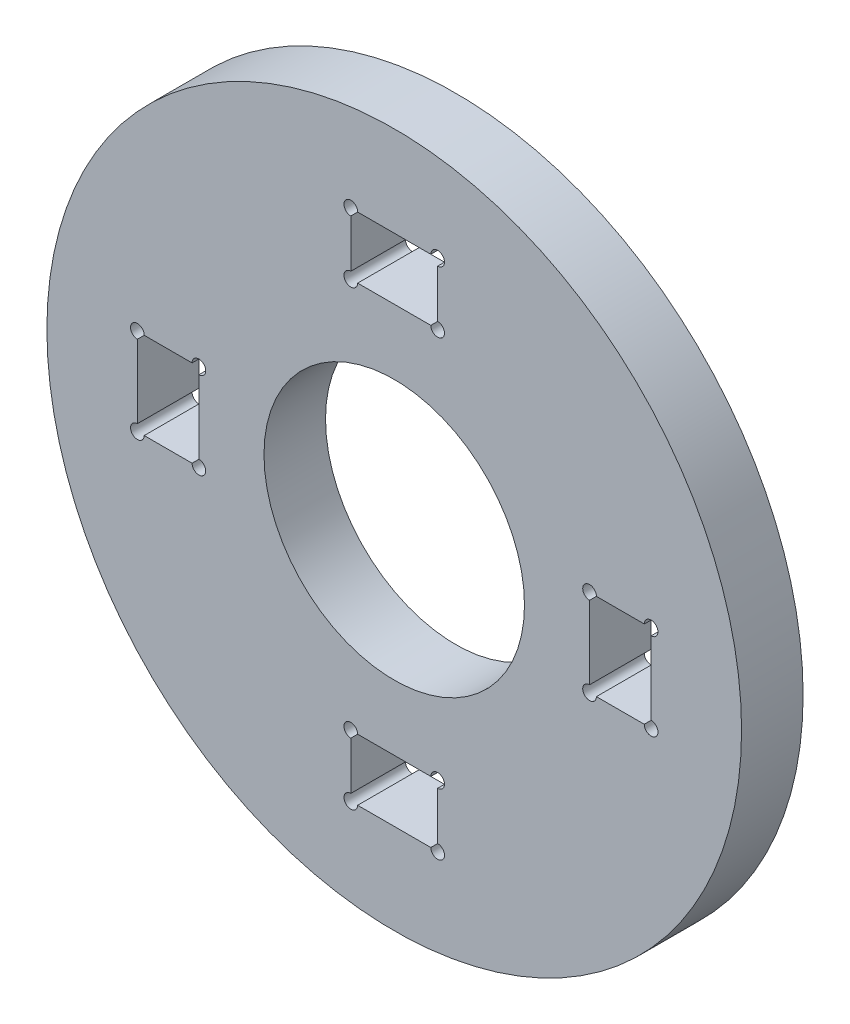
from build123d import *

# Parameters (mm, degrees)
SKETCH1_R           = 25.4
SKETCH1_R_2         = 2.5
BOSS_EXTRUDE1_DEPTH = 4.5
CUT_EXTRUDE1_DEPTH  = 37.201795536
SKETCH3_R           = 9.525
CUT_EXTRUDE2_DEPTH  = 37.201795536


with BuildPart() as part:
    # Sketch1 → Boss-Extrude1 (new body)
    with BuildSketch(Plane.XY):
        Circle(SKETCH1_R)
        Circle(SKETCH1_R_2, mode=Mode.SUBTRACT)
    extrude(amount=BOSS_EXTRUDE1_DEPTH)

    # Sketch2 → Cut-Extrude1 (cut, through all)
    with BuildSketch(Plane.XY.offset(4.5)):
        with BuildLine():
            Line((-14.783553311, 3.175), (-17.171437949, 3.175))
            ThreePointArc((-17.171437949, 3.175), (-17.4625, 0), (-17.171437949, -3.175))
            Line((-17.171437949, -3.175), (-14.783553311, -3.175))
            Line((-14.783553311, -3.175), (-14.283553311, -3.175))
            Line((-14.283553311, -3.175), (-14.283553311, -2.675))
            Line((-14.283553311, -2.675), (-14.283553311, 2.675))
            Line((-14.283553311, 2.675), (-14.283553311, 3.175))
            Line((-14.283553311, 3.175), (-14.783553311, 3.175))
        make_face()
        with BuildLine():
            ThreePointArc((-17.171437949, -3.175), (-17.4625, 0), (-17.171437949, 3.175))
            Line((-17.171437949, 3.175), (-18.283553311, 3.175))
            Line((-18.283553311, 3.175), (-18.783553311, 3.175))
            Line((-18.783553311, 3.175), (-18.783553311, 2.675))
            Line((-18.783553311, 2.675), (-18.783553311, -2.675))
            Line((-18.783553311, -2.675), (-18.783553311, -3.175))
            Line((-18.783553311, -3.175), (-18.283553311, -3.175))
            Line((-18.283553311, -3.175), (-17.171437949, -3.175))
        make_face()
        with BuildLine():
            Line((2.675, 18.783553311), (0, 18.783553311))
            Line((0, 18.783553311), (0, 17.4625))
            ThreePointArc((0, 17.4625), (1.594156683, 17.389582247), (3.175, 17.171437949))
            Line((3.175, 17.171437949), (3.175, 18.283553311))
            Line((3.175, 18.283553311), (3.175, 18.783553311))
            Line((3.175, 18.783553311), (2.675, 18.783553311))
        make_face()
        with BuildLine():
            Line((0, 17.4625), (0, 18.783553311))
            Line((0, 18.783553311), (-2.675, 18.783553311))
            Line((-2.675, 18.783553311), (-3.175, 18.783553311))
            Line((-3.175, 18.783553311), (-3.175, 18.283553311))
            Line((-3.175, 18.283553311), (-3.175, 17.171437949))
            ThreePointArc((-3.175, 17.171437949), (-1.594156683, 17.389582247), (0, 17.4625))
        make_face()
        with BuildLine():
            Line((0, 14.283553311), (0, 17.4625))
            ThreePointArc((0, 17.4625), (-1.594156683, 17.389582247), (-3.175, 17.171437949))
            Line((-3.175, 17.171437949), (-3.175, 14.783553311))
            Line((-3.175, 14.783553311), (-3.175, 14.283553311))
            Line((-3.175, 14.283553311), (-2.675, 14.283553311))
            Line((-2.675, 14.283553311), (0, 14.283553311))
        make_face()
        with BuildLine():
            ThreePointArc((3.175, 17.171437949), (1.594156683, 17.389582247), (0, 17.4625))
            Line((0, 17.4625), (0, 14.283553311))
            Line((0, 14.283553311), (2.675, 14.283553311))
            Line((2.675, 14.283553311), (3.175, 14.283553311))
            Line((3.175, 14.283553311), (3.175, 14.783553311))
            Line((3.175, 14.783553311), (3.175, 17.171437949))
        make_face()
        with BuildLine():
            ThreePointArc((17.4625, 0), (17.389582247, 1.594156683), (17.171437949, 3.175))
            Line((17.171437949, 3.175), (14.783553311, 3.175))
            Line((14.783553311, 3.175), (14.283553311, 3.175))
            Line((14.283553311, 3.175), (14.283553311, 2.675))
            Line((14.283553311, 2.675), (14.283553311, -2.675))
            Line((14.283553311, -2.675), (14.283553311, -3.175))
            Line((14.283553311, -3.175), (14.783553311, -3.175))
            Line((14.783553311, -3.175), (17.171437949, -3.175))
            ThreePointArc((17.171437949, -3.175), (17.389582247, -1.594156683), (17.4625, 0))
        make_face()
        with BuildLine():
            Line((18.283553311, 3.175), (17.171437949, 3.175))
            ThreePointArc((17.171437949, 3.175), (17.389582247, 1.594156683), (17.4625, 0))
            ThreePointArc((17.4625, 0), (17.389582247, -1.594156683), (17.171437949, -3.175))
            Line((17.171437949, -3.175), (18.283553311, -3.175))
            Line((18.283553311, -3.175), (18.783553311, -3.175))
            Line((18.783553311, -3.175), (18.783553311, -2.675))
            Line((18.783553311, -2.675), (18.783553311, 2.675))
            Line((18.783553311, 2.675), (18.783553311, 3.175))
            Line((18.783553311, 3.175), (18.283553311, 3.175))
        make_face()
        with BuildLine():
            Line((-3.175, -14.783553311), (-3.175, -17.171437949))
            ThreePointArc((-3.175, -17.171437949), (0, -17.4625), (3.175, -17.171437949))
            Line((3.175, -17.171437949), (3.175, -14.783553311))
            Line((3.175, -14.783553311), (3.175, -14.283553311))
            Line((3.175, -14.283553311), (2.675, -14.283553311))
            Line((2.675, -14.283553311), (-2.675, -14.283553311))
            Line((-2.675, -14.283553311), (-3.175, -14.283553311))
            Line((-3.175, -14.283553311), (-3.175, -14.783553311))
        make_face()
        with BuildLine():
            ThreePointArc((3.175, -17.171437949), (0, -17.4625), (-3.175, -17.171437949))
            Line((-3.175, -17.171437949), (-3.175, -18.283553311))
            Line((-3.175, -18.283553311), (-3.175, -18.783553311))
            Line((-3.175, -18.783553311), (-2.675, -18.783553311))
            Line((-2.675, -18.783553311), (2.675, -18.783553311))
            Line((2.675, -18.783553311), (3.175, -18.783553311))
            Line((3.175, -18.783553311), (3.175, -18.283553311))
            Line((3.175, -18.283553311), (3.175, -17.171437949))
        make_face()
        with BuildLine():
            Line((-3.175, 18.283553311), (-3.175, 18.783553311))
            ThreePointArc((-3.175, 18.783553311), (-3.421229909, 18.740269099), (-3.66687058, 18.693757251))
            ThreePointArc((-3.66687058, 18.693757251), (-3.495235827, 18.399562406), (-3.175, 18.283553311))
        make_face()
        with BuildLine():
            Line((-3.175, 18.783553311), (-2.675, 18.783553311))
            ThreePointArc((-2.675, 18.783553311), (-2.676487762, 18.822096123), (-2.680942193, 18.860409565))
            ThreePointArc((-2.680942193, 18.860409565), (-2.928223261, 18.823602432), (-3.175, 18.783553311))
        make_face()
        with BuildLine():
            ThreePointArc((-3.66687058, 18.693757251), (-3.421229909, 18.740269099), (-3.175, 18.783553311))
            ThreePointArc((-3.175, 18.783553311), (-2.928223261, 18.823602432), (-2.680942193, 18.860409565))
            ThreePointArc((-2.680942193, 18.860409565), (-3.258333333, 19.27655996), (-3.66687058, 18.693757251))
        make_face()
        with BuildLine():
            ThreePointArc((2.680942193, 18.860409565), (2.676487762, 18.822096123), (2.675, 18.783553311))
            Line((2.675, 18.783553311), (3.175, 18.783553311))
            ThreePointArc((3.175, 18.783553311), (2.928223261, 18.823602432), (2.680942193, 18.860409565))
        make_face()
        with BuildLine():
            ThreePointArc((2.680942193, 18.860409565), (2.928223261, 18.823602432), (3.175, 18.783553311))
            ThreePointArc((3.175, 18.783553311), (3.421229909, 18.740269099), (3.66687058, 18.693757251))
            ThreePointArc((3.66687058, 18.693757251), (3.258333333, 19.27655996), (2.680942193, 18.860409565))
        make_face()
        with BuildLine():
            ThreePointArc((3.66687058, 18.693757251), (3.421229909, 18.740269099), (3.175, 18.783553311))
            Line((3.175, 18.783553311), (3.175, 18.283553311))
            ThreePointArc((3.175, 18.283553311), (3.495235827, 18.399562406), (3.66687058, 18.693757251))
        make_face()
        with BuildLine():
            Line((3.175, 14.283553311), (2.675, 14.283553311))
            ThreePointArc((2.675, 14.283553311), (3.528553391, 13.929999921), (3.175, 14.783553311))
            Line((3.175, 14.783553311), (3.175, 14.283553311))
        make_face()
        with BuildLine():
            ThreePointArc((-3.175, 14.783553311), (-3.528553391, 13.929999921), (-2.675, 14.283553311))
            Line((-2.675, 14.283553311), (-3.175, 14.283553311))
            Line((-3.175, 14.283553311), (-3.175, 14.783553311))
        make_face()
        with BuildLine():
            Line((14.283553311, -3.175), (14.283553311, -2.675))
            ThreePointArc((14.283553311, -2.675), (13.929999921, -3.528553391), (14.783553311, -3.175))
            Line((14.783553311, -3.175), (14.283553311, -3.175))
        make_face()
        with BuildLine():
            Line((14.283553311, 3.175), (14.783553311, 3.175))
            ThreePointArc((14.783553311, 3.175), (13.929999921, 3.528553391), (14.283553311, 2.675))
            Line((14.283553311, 2.675), (14.283553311, 3.175))
        make_face()
        with BuildLine():
            ThreePointArc((18.693757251, 3.66687058), (18.399562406, 3.495235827), (18.283553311, 3.175))
            Line((18.283553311, 3.175), (18.783553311, 3.175))
            ThreePointArc((18.783553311, 3.175), (18.740269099, 3.421229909), (18.693757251, 3.66687058))
        make_face()
        with BuildLine():
            ThreePointArc((18.860409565, 2.680942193), (19.27655996, 3.258333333), (18.693757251, 3.66687058))
            ThreePointArc((18.693757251, 3.66687058), (18.740269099, 3.421229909), (18.783553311, 3.175))
            ThreePointArc((18.783553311, 3.175), (18.823602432, 2.928223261), (18.860409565, 2.680942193))
        make_face()
        with BuildLine():
            ThreePointArc((18.860409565, 2.680942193), (18.823602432, 2.928223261), (18.783553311, 3.175))
            Line((18.783553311, 3.175), (18.783553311, 2.675))
            ThreePointArc((18.783553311, 2.675), (18.822096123, 2.676487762), (18.860409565, 2.680942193))
        make_face()
        with BuildLine():
            Line((18.783553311, -3.175), (18.283553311, -3.175))
            ThreePointArc((18.283553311, -3.175), (18.399562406, -3.495235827), (18.693757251, -3.66687058))
            ThreePointArc((18.693757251, -3.66687058), (18.740269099, -3.421229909), (18.783553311, -3.175))
        make_face()
        with BuildLine():
            ThreePointArc((18.860409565, -2.680942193), (18.823602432, -2.928223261), (18.783553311, -3.175))
            ThreePointArc((18.783553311, -3.175), (18.740269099, -3.421229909), (18.693757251, -3.66687058))
            ThreePointArc((18.693757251, -3.66687058), (19.27655996, -3.258333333), (18.860409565, -2.680942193))
        make_face()
        with BuildLine():
            ThreePointArc((18.860409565, -2.680942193), (18.822096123, -2.676487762), (18.783553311, -2.675))
            Line((18.783553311, -2.675), (18.783553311, -3.175))
            ThreePointArc((18.783553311, -3.175), (18.823602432, -2.928223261), (18.860409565, -2.680942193))
        make_face()
        with BuildLine():
            ThreePointArc((-3.175, -18.783553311), (-3.421229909, -18.740269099), (-3.66687058, -18.693757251))
            ThreePointArc((-3.66687058, -18.693757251), (-3.258333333, -19.27655996), (-2.680942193, -18.860409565))
            ThreePointArc((-2.680942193, -18.860409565), (-2.928223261, -18.823602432), (-3.175, -18.783553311))
        make_face()
        with BuildLine():
            ThreePointArc((-2.675, -14.283553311), (-3.528553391, -13.929999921), (-3.175, -14.783553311))
            Line((-3.175, -14.783553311), (-3.175, -14.283553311))
            Line((-3.175, -14.283553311), (-2.675, -14.283553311))
        make_face()
        with BuildLine():
            Line((3.175, -14.283553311), (3.175, -14.783553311))
            ThreePointArc((3.175, -14.783553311), (3.528553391, -13.929999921), (2.675, -14.283553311))
            Line((2.675, -14.283553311), (3.175, -14.283553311))
        make_face()
        with BuildLine():
            ThreePointArc((2.680942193, -18.860409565), (3.258333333, -19.27655996), (3.66687058, -18.693757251))
            ThreePointArc((3.66687058, -18.693757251), (3.421229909, -18.740269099), (3.175, -18.783553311))
            ThreePointArc((3.175, -18.783553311), (2.928223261, -18.823602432), (2.680942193, -18.860409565))
        make_face()
        with BuildLine():
            ThreePointArc((3.66687058, -18.693757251), (3.495235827, -18.399562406), (3.175, -18.283553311))
            Line((3.175, -18.283553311), (3.175, -18.783553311))
            ThreePointArc((3.175, -18.783553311), (3.421229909, -18.740269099), (3.66687058, -18.693757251))
        make_face()
        with BuildLine():
            ThreePointArc((2.680942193, -18.860409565), (2.928223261, -18.823602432), (3.175, -18.783553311))
            Line((3.175, -18.783553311), (2.675, -18.783553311))
            ThreePointArc((2.675, -18.783553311), (2.676487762, -18.822096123), (2.680942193, -18.860409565))
        make_face()
        with BuildLine():
            Line((-3.175, -18.783553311), (-3.175, -18.283553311))
            ThreePointArc((-3.175, -18.283553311), (-3.495235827, -18.399562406), (-3.66687058, -18.693757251))
            ThreePointArc((-3.66687058, -18.693757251), (-3.421229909, -18.740269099), (-3.175, -18.783553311))
        make_face()
        with BuildLine():
            Line((-2.675, -18.783553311), (-3.175, -18.783553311))
            ThreePointArc((-3.175, -18.783553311), (-2.928223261, -18.823602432), (-2.680942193, -18.860409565))
            ThreePointArc((-2.680942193, -18.860409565), (-2.676487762, -18.822096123), (-2.675, -18.783553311))
        make_face()
        with BuildLine():
            ThreePointArc((-18.783553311, 3.175), (-18.740269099, 3.421229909), (-18.693757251, 3.66687058))
            ThreePointArc((-18.693757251, 3.66687058), (-19.27655996, 3.258333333), (-18.860409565, 2.680942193))
            ThreePointArc((-18.860409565, 2.680942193), (-18.823602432, 2.928223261), (-18.783553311, 3.175))
        make_face()
        with BuildLine():
            Line((-18.783553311, 3.175), (-18.283553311, 3.175))
            ThreePointArc((-18.283553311, 3.175), (-18.399562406, 3.495235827), (-18.693757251, 3.66687058))
            ThreePointArc((-18.693757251, 3.66687058), (-18.740269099, 3.421229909), (-18.783553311, 3.175))
        make_face()
        with BuildLine():
            Line((-18.783553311, 2.675), (-18.783553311, 3.175))
            ThreePointArc((-18.783553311, 3.175), (-18.823602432, 2.928223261), (-18.860409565, 2.680942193))
            ThreePointArc((-18.860409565, 2.680942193), (-18.822096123, 2.676487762), (-18.783553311, 2.675))
        make_face()
        with BuildLine():
            ThreePointArc((-14.283553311, 2.675), (-13.929999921, 3.528553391), (-14.783553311, 3.175))
            Line((-14.783553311, 3.175), (-14.283553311, 3.175))
            Line((-14.283553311, 3.175), (-14.283553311, 2.675))
        make_face()
        with BuildLine():
            Line((-14.283553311, -3.175), (-14.783553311, -3.175))
            ThreePointArc((-14.783553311, -3.175), (-13.929999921, -3.528553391), (-14.283553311, -2.675))
            Line((-14.283553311, -2.675), (-14.283553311, -3.175))
        make_face()
        with BuildLine():
            ThreePointArc((-18.693757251, -3.66687058), (-18.399562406, -3.495235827), (-18.283553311, -3.175))
            Line((-18.283553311, -3.175), (-18.783553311, -3.175))
            ThreePointArc((-18.783553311, -3.175), (-18.740269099, -3.421229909), (-18.693757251, -3.66687058))
        make_face()
        with BuildLine():
            ThreePointArc((-18.693757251, -3.66687058), (-18.740269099, -3.421229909), (-18.783553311, -3.175))
            ThreePointArc((-18.783553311, -3.175), (-18.823602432, -2.928223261), (-18.860409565, -2.680942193))
            ThreePointArc((-18.860409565, -2.680942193), (-19.27655996, -3.258333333), (-18.693757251, -3.66687058))
        make_face()
        with BuildLine():
            ThreePointArc((-18.860409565, -2.680942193), (-18.823602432, -2.928223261), (-18.783553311, -3.175))
            Line((-18.783553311, -3.175), (-18.783553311, -2.675))
            ThreePointArc((-18.783553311, -2.675), (-18.822096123, -2.676487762), (-18.860409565, -2.680942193))
        make_face()
    extrude(amount=-CUT_EXTRUDE1_DEPTH, mode=Mode.SUBTRACT)

    # Sketch3 → Cut-Extrude2 (cut, through all)
    with BuildSketch(Plane.XY.offset(4.5)):
        Circle(SKETCH3_R)
    extrude(amount=-CUT_EXTRUDE2_DEPTH, mode=Mode.SUBTRACT)


solid = part.part
